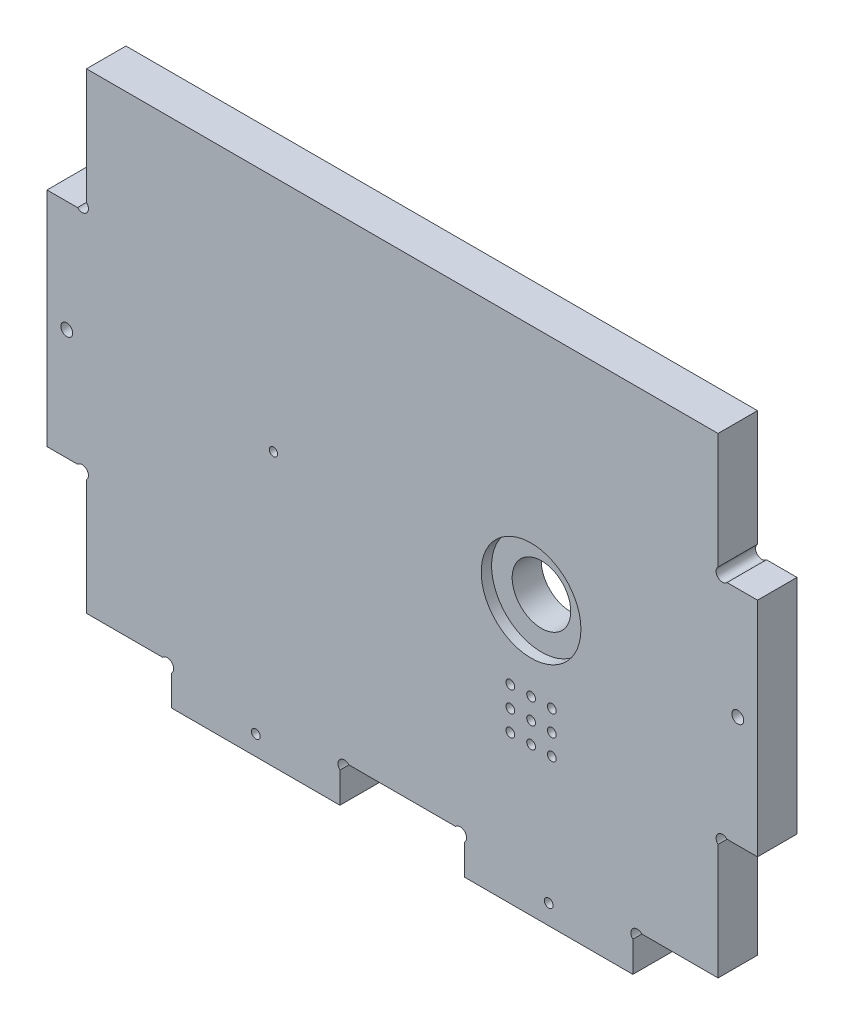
from build123d import *

# Parameters (mm, degrees)
ESQUISSE1_R             = 2.866863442
ESQUISSE1_R_2           = 2.1
BOSS_EXTRU_1_DEPTH      = 19
ESQUISSE2_R             = 14.1
ESQUISSE2_R_2           = 2
ESQUISSE2_R_3           = 2.1
ENL_V_MAT_EXTRU_1_DEPTH = 301.196602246
ESQUISSE3_R             = 24
ENL_V_MAT_EXTRU_2_DEPTH = 5


with BuildPart() as part:
    # Esquisse1 → Boss.-Extru.1 (new body)
    with BuildSketch(Plane.XY):
        with BuildLine():
            Line((-171, 186), (-171, 79))
            Line((-171, 79), (-156.311899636, 79))
            ThreePointArc((-156.311899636, 79), (-151.943324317, 79.056675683), (-152, 74.688100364))
            Line((-152, 74.688100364), (-152, 19))
            Line((-152, 19), (-115.311899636, 19))
            ThreePointArc((-115.311899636, 19), (-110.943324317, 19.056675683), (-111, 14.688100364))
            Line((-111, 14.688100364), (-111, 0))
            Line((-111, 0), (-30, 0))
            Line((-30, 0), (-30, 14.688100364))
            ThreePointArc((-30, 14.688100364), (-30.056675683, 19.056675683), (-25.688100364, 19))
            Line((-25.688100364, 19), (25.688100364, 19))
            ThreePointArc((25.688100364, 19), (30.056675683, 19.056675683), (30, 14.688100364))
            Line((30, 14.688100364), (30, 0))
            Line((30, 0), (111, 0))
            Line((111, 0), (111, 14.688100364))
            ThreePointArc((111, 14.688100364), (110.943324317, 19.056675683), (115.311899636, 19))
            Line((115.311899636, 19), (152, 19))
            Line((152, 19), (152, 74.688100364))
            ThreePointArc((152, 74.688100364), (151.943324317, 79.056675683), (156.311899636, 79))
            Line((156.311899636, 79), (171, 79))
            Line((171, 79), (171, 186))
            Line((171, 186), (156.311899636, 186))
            ThreePointArc((156.311899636, 186), (151.943324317, 185.943324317), (152, 190.311899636))
            Line((152, 190.311899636), (152, 246))
            Line((152, 246), (-152, 246))
            Line((-152, 246), (-152, 190.311899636))
            ThreePointArc((-152, 190.311899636), (-151.943324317, 185.943324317), (-156.311899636, 186))
            Line((-156.311899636, 186), (-171, 186))
        make_face()
        with Locations((161.5, 132.5)):
            Circle(ESQUISSE1_R, mode=Mode.SUBTRACT)
        with Locations(Location((-161.5, 132.5, 0), (0, 0, 180))):
            Circle(ESQUISSE1_R, mode=Mode.SUBTRACT)
        with Locations((70.5, 9.5)):
            Circle(ESQUISSE1_R_2, mode=Mode.SUBTRACT)
        with Locations(Location((-70.5, 9.5, 0), (0, 0, 180))):
            Circle(ESQUISSE1_R_2, mode=Mode.SUBTRACT)
    extrude(amount=BOSS_EXTRU_1_DEPTH)

    # Esquisse2 → Enl_v. mat.-Extru.1 (cut, through all)
    with BuildSketch(Plane.XY.offset(19)):
        with Locations((62, 131.327177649)):
            Circle(ESQUISSE2_R)
        with Locations((-62, 131.327177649)):
            Circle(ESQUISSE2_R_2)
        with Locations((62, 81.327177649)):
            Circle(ESQUISSE2_R_3)
        with Locations((72, 81.327177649)):
            Circle(ESQUISSE2_R_3)
        with Locations((62, 91.327177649)):
            Circle(ESQUISSE2_R_3)
        with Locations((72, 91.327177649)):
            Circle(ESQUISSE2_R_3)
        with Locations(Location((52, 91.327177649, 0), (0, 0, 180))):
            Circle(ESQUISSE2_R_3)
        with Locations(Location((52, 81.327177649, 0), (0, 0, 180))):
            Circle(ESQUISSE2_R_3)
        with Locations(Location((72, 71.327177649, 0), (0, 0, 180))):
            Circle(ESQUISSE2_R_3)
        with Locations((52, 71.327177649)):
            Circle(ESQUISSE2_R_3)
        with Locations(Location((62, 71.327177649, 0), (0, 0, 180))):
            Circle(ESQUISSE2_R_3)
    extrude(amount=-ENL_V_MAT_EXTRU_1_DEPTH, mode=Mode.SUBTRACT)

    # Esquisse3 → Enl_v. mat.-Extru.2 (cut)
    with BuildSketch(Plane.XY.offset(19)):
        with Locations((62, 131.327177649)):
            Circle(ESQUISSE3_R)
    extrude(amount=-ENL_V_MAT_EXTRU_2_DEPTH, mode=Mode.SUBTRACT)


solid = part.part
